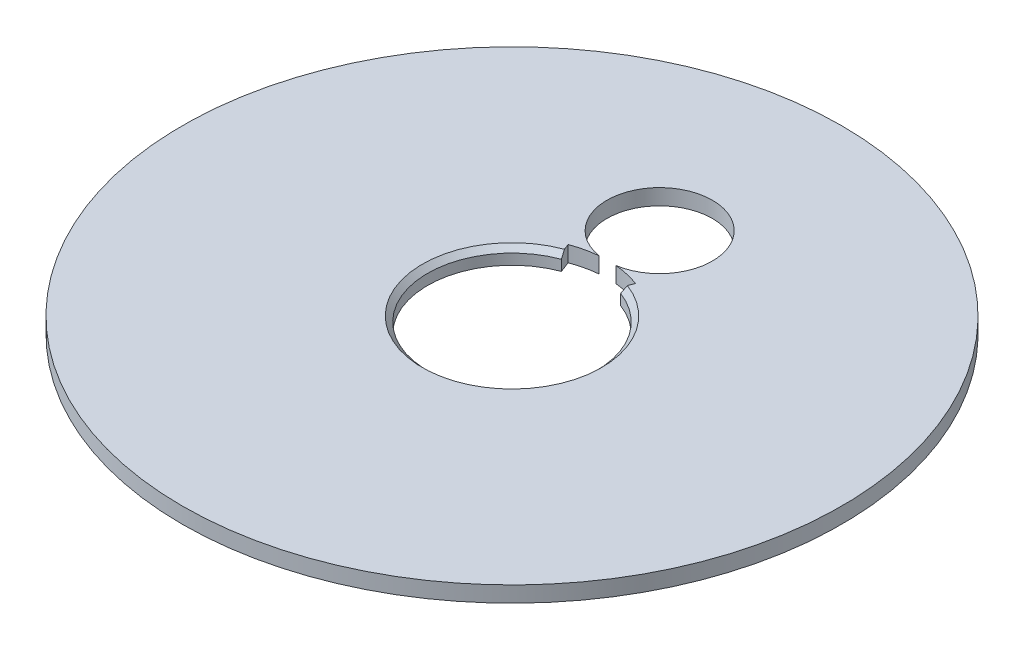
ISO-10303-21;
HEADER;
FILE_DESCRIPTION(('STEP AP214'),'2;1');
FILE_NAME('part.step','',(''),(''),'','','');
FILE_SCHEMA(('AUTOMOTIVE_DESIGN { 1 0 10303 214 1 1 1 1 }'));
ENDSEC;
DATA;
#1=APPLICATION_CONTEXT('core data for automotive mechanical design processes');
#2=APPLICATION_PROTOCOL_DEFINITION('international standard','automotive_design',2000,#1);
#3=PRODUCT_CONTEXT('',#1,'mechanical');
#4=PRODUCT('Part','Part','',(#3));
#5=PRODUCT_RELATED_PRODUCT_CATEGORY('part','',(#4));
#6=PRODUCT_DEFINITION_FORMATION('','',#4);
#7=PRODUCT_DEFINITION_CONTEXT('part definition',#1,'design');
#8=PRODUCT_DEFINITION('design','',#6,#7);
#9=PRODUCT_DEFINITION_SHAPE('','',#8);
#10=(LENGTH_UNIT() NAMED_UNIT(*) SI_UNIT(.MILLI.,.METRE.));
#11=(NAMED_UNIT(*) PLANE_ANGLE_UNIT() SI_UNIT($,.RADIAN.));
#12=(NAMED_UNIT(*) SI_UNIT($,.STERADIAN.) SOLID_ANGLE_UNIT());
#13=UNCERTAINTY_MEASURE_WITH_UNIT(LENGTH_MEASURE(1.E-05),#10,'distance_accuracy_value','');
#14=(GEOMETRIC_REPRESENTATION_CONTEXT(3) GLOBAL_UNCERTAINTY_ASSIGNED_CONTEXT((#13)) GLOBAL_UNIT_ASSIGNED_CONTEXT((#10,
#11,#12)) REPRESENTATION_CONTEXT('',''));
#15=CARTESIAN_POINT('',(0.,0.,0.));
#16=DIRECTION('',(0.,0.,1.));
#17=DIRECTION('',(1.,0.,0.));
#18=AXIS2_PLACEMENT_3D('',#15,#16,#17);
#19=CARTESIAN_POINT('',(0.,-1.5,0.));
#20=DIRECTION('',(0.,1.,0.));
#21=DIRECTION('',(0.,0.,1.));
#22=AXIS2_PLACEMENT_3D('',#19,#20,#21);
#23=CYLINDRICAL_SURFACE('',#22,9.1);
#24=CARTESIAN_POINT('',(0.,-1.5,0.));
#25=DIRECTION('',(0.,1.,0.));
#26=DIRECTION('',(0.,0.,1.));
#27=AXIS2_PLACEMENT_3D('',#24,#25,#26);
#28=CIRCLE('',#27,9.1);
#29=CARTESIAN_POINT('',(-0.801404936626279,-1.5,-9.06464285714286));
#30=VERTEX_POINT('',#29);
#31=CARTESIAN_POINT('',(-3.19522331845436,-1.5,-8.52059551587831));
#32=VERTEX_POINT('',#31);
#33=EDGE_CURVE('E160',#30,#32,#28,.T.);
#34=ORIENTED_EDGE('',*,*,#33,.F.);
#35=DIRECTION('',(0.,1.,0.));
#36=VECTOR('',#35,1.);
#37=CARTESIAN_POINT('',(-0.801404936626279,-5.,-9.06464285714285));
#38=LINE('',#37,#36);
#39=CARTESIAN_POINT('',(-0.801404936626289,0.,-9.06464285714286));
#40=VERTEX_POINT('',#39);
#41=EDGE_CURVE('E11',#30,#40,#38,.T.);
#42=ORIENTED_EDGE('',*,*,#41,.T.);
#43=CARTESIAN_POINT('',(0.,0.,0.));
#44=DIRECTION('',(0.,1.,0.));
#45=DIRECTION('',(0.,0.,1.));
#46=AXIS2_PLACEMENT_3D('',#43,#44,#45);
#47=CIRCLE('',#46,9.1);
#48=CARTESIAN_POINT('',(-3.19522331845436,0.,-8.52059551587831));
#49=VERTEX_POINT('',#48);
#50=EDGE_CURVE('E103',#40,#49,#47,.T.);
#51=ORIENTED_EDGE('',*,*,#50,.T.);
#52=DIRECTION('',(0.,1.,0.));
#53=VECTOR('',#52,1.);
#54=CARTESIAN_POINT('',(-3.19522331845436,-1.5,-8.52059551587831));
#55=LINE('',#54,#53);
#56=EDGE_CURVE('E125',#32,#49,#55,.T.);
#57=ORIENTED_EDGE('',*,*,#56,.F.);
#58=EDGE_LOOP('',(#34,#42,#51,#57));
#59=FACE_BOUND('',#58,.T.);
#60=ADVANCED_FACE('F32',(#59),#23,.F.);
#61=CARTESIAN_POINT('',(0.,-1.5,0.));
#62=DIRECTION('',(0.,1.,0.));
#63=DIRECTION('',(0.,0.,1.));
#64=AXIS2_PLACEMENT_3D('',#61,#62,#63);
#65=CYLINDRICAL_SURFACE('',#64,31.25);
#66=CARTESIAN_POINT('',(0.,-1.5,0.));
#67=DIRECTION('',(0.,1.,0.));
#68=DIRECTION('',(0.,0.,1.));
#69=AXIS2_PLACEMENT_3D('',#66,#67,#68);
#70=CIRCLE('',#69,31.25);
#71=CARTESIAN_POINT('',(0.,-1.5,31.25));
#72=VERTEX_POINT('',#71);
#73=EDGE_CURVE('E129',#72,#72,#70,.T.);
#74=ORIENTED_EDGE('',*,*,#73,.T.);
#75=EDGE_LOOP('',(#74));
#76=FACE_BOUND('',#75,.T.);
#77=CARTESIAN_POINT('',(0.,0.,0.));
#78=DIRECTION('',(0.,1.,0.));
#79=DIRECTION('',(0.,0.,1.));
#80=AXIS2_PLACEMENT_3D('',#77,#78,#79);
#81=CIRCLE('',#80,31.25);
#82=CARTESIAN_POINT('',(0.,0.,31.25));
#83=VERTEX_POINT('',#82);
#84=EDGE_CURVE('E121',#83,#83,#81,.T.);
#85=ORIENTED_EDGE('',*,*,#84,.F.);
#86=EDGE_LOOP('',(#85));
#87=FACE_BOUND('',#86,.T.);
#88=ADVANCED_FACE('F168',(#76,#87),#65,.T.);
#89=CARTESIAN_POINT('',(0.,-1.5,0.));
#90=DIRECTION('',(0.,1.,0.));
#91=DIRECTION('',(0.,0.,1.));
#92=AXIS2_PLACEMENT_3D('',#89,#90,#91);
#93=PLANE('',#92);
#94=CARTESIAN_POINT('',(3.19522331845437,-1.5,-8.5205955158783));
#95=VERTEX_POINT('',#94);
#96=CARTESIAN_POINT('',(0.80140493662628,-1.5,-9.06464285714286));
#97=VERTEX_POINT('',#96);
#98=EDGE_CURVE('E159',#95,#97,#28,.T.);
#99=ORIENTED_EDGE('',*,*,#98,.T.);
#100=CARTESIAN_POINT('',(0.,-1.5,-14.));
#101=DIRECTION('',(0.,1.,0.));
#102=DIRECTION('',(0.,0.,1.));
#103=AXIS2_PLACEMENT_3D('',#100,#101,#102);
#104=CIRCLE('',#103,5.);
#105=EDGE_CURVE('E47',#97,#30,#104,.T.);
#106=ORIENTED_EDGE('',*,*,#105,.T.);
#107=ORIENTED_EDGE('',*,*,#33,.T.);
#108=DIRECTION('',(0.351123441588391,0.,0.936329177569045));
#109=VECTOR('',#108,1.);
#110=CARTESIAN_POINT('',(-3.,-1.5,-8.));
#111=LINE('',#110,#109);
#112=CARTESIAN_POINT('',(-2.80898753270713,-1.5,-7.49063342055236));
#113=VERTEX_POINT('',#112);
#114=EDGE_CURVE('E158',#32,#113,#111,.T.);
#115=ORIENTED_EDGE('',*,*,#114,.T.);
#116=CARTESIAN_POINT('',(0.,-1.5,0.));
#117=DIRECTION('',(0.,1.,0.));
#118=DIRECTION('',(0.,0.,1.));
#119=AXIS2_PLACEMENT_3D('',#116,#117,#118);
#120=CIRCLE('',#119,8.);
#121=CARTESIAN_POINT('',(2.80898753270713,-1.5,-7.49063342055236));
#122=VERTEX_POINT('',#121);
#123=EDGE_CURVE('E113',#113,#122,#120,.T.);
#124=ORIENTED_EDGE('',*,*,#123,.T.);
#125=DIRECTION('',(0.351123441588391,0.,-0.936329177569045));
#126=VECTOR('',#125,1.);
#127=CARTESIAN_POINT('',(3.,-1.5,-8.));
#128=LINE('',#127,#126);
#129=EDGE_CURVE('E117',#122,#95,#128,.T.);
#130=ORIENTED_EDGE('',*,*,#129,.T.);
#131=EDGE_LOOP('',(#99,#106,#107,#115,#124,#130));
#132=FACE_BOUND('',#131,.T.);
#133=ORIENTED_EDGE('',*,*,#73,.F.);
#134=EDGE_LOOP('',(#133));
#135=FACE_BOUND('',#134,.T.);
#136=ADVANCED_FACE('F156',(#132,#135),#93,.F.);
#137=CARTESIAN_POINT('',(0.,0.,0.));
#138=DIRECTION('',(0.,1.,0.));
#139=DIRECTION('',(0.,0.,1.));
#140=AXIS2_PLACEMENT_3D('',#137,#138,#139);
#141=PLANE('',#140);
#142=CARTESIAN_POINT('',(0.,0.,-14.));
#143=DIRECTION('',(0.,1.,0.));
#144=DIRECTION('',(0.,0.,1.));
#145=AXIS2_PLACEMENT_3D('',#142,#143,#144);
#146=CIRCLE('',#145,5.);
#147=CARTESIAN_POINT('',(0.801404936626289,0.,-9.06464285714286));
#148=VERTEX_POINT('',#147);
#149=EDGE_CURVE('E92',#148,#40,#146,.T.);
#150=ORIENTED_EDGE('',*,*,#149,.F.);
#151=CARTESIAN_POINT('',(3.19522331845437,0.,-8.52059551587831));
#152=VERTEX_POINT('',#151);
#153=EDGE_CURVE('E102',#152,#148,#47,.T.);
#154=ORIENTED_EDGE('',*,*,#153,.F.);
#155=DIRECTION('',(0.351123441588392,0.,-0.936329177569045));
#156=VECTOR('',#155,1.);
#157=CARTESIAN_POINT('',(2.80898753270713,0.,-7.49063342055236));
#158=LINE('',#157,#156);
#159=CARTESIAN_POINT('',(2.98454925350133,0.,-7.95879800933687));
#160=VERTEX_POINT('',#159);
#161=EDGE_CURVE('E110',#160,#152,#158,.T.);
#162=ORIENTED_EDGE('',*,*,#161,.F.);
#163=CARTESIAN_POINT('',(0.,0.,0.));
#164=DIRECTION('',(0.,1.,0.));
#165=DIRECTION('',(0.,0.,1.));
#166=AXIS2_PLACEMENT_3D('',#163,#164,#165);
#167=CIRCLE('',#166,8.49999999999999);
#168=CARTESIAN_POINT('',(-2.98454925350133,0.,-7.95879800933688));
#169=VERTEX_POINT('',#168);
#170=EDGE_CURVE('E55',#160,#169,#167,.F.);
#171=ORIENTED_EDGE('',*,*,#170,.T.);
#172=DIRECTION('',(0.351123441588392,0.,0.936329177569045));
#173=VECTOR('',#172,1.);
#174=CARTESIAN_POINT('',(-2.80898753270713,0.,-7.49063342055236));
#175=LINE('',#174,#173);
#176=EDGE_CURVE('E108',#49,#169,#175,.T.);
#177=ORIENTED_EDGE('',*,*,#176,.F.);
#178=ORIENTED_EDGE('',*,*,#50,.F.);
#179=EDGE_LOOP('',(#150,#154,#162,#171,#177,#178));
#180=FACE_BOUND('',#179,.T.);
#181=ORIENTED_EDGE('',*,*,#84,.T.);
#182=EDGE_LOOP('',(#181));
#183=FACE_BOUND('',#182,.T.);
#184=ADVANCED_FACE('F100',(#180,#183),#141,.T.);
#185=CARTESIAN_POINT('',(2.80898753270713,-1.5,-7.49063342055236));
#186=DIRECTION('',(0.936329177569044,0.,0.351123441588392));
#187=DIRECTION('',(0.351123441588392,0.,-0.936329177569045));
#188=AXIS2_PLACEMENT_3D('',#185,#186,#187);
#189=PLANE('',#188);
#190=DIRECTION('',(0.,1.,0.));
#191=VECTOR('',#190,1.);
#192=CARTESIAN_POINT('',(2.80898753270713,-1.5,-7.49063342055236));
#193=LINE('',#192,#191);
#194=CARTESIAN_POINT('',(2.80898753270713,-0.49999999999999,-7.49063342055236));
#195=VERTEX_POINT('',#194);
#196=EDGE_CURVE('E118',#122,#195,#193,.T.);
#197=ORIENTED_EDGE('',*,*,#196,.T.);
#198=DIRECTION('',(0.24828176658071,0.707106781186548,-0.662084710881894));
#199=VECTOR('',#198,1.);
#200=CARTESIAN_POINT('',(0.,-8.49999999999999,0.));
#201=LINE('',#200,#199);
#202=EDGE_CURVE('E137',#195,#160,#201,.T.);
#203=ORIENTED_EDGE('',*,*,#202,.T.);
#204=ORIENTED_EDGE('',*,*,#161,.T.);
#205=DIRECTION('',(0.,1.,0.));
#206=VECTOR('',#205,1.);
#207=CARTESIAN_POINT('',(3.19522331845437,-1.5,-8.5205955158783));
#208=LINE('',#207,#206);
#209=EDGE_CURVE('E107',#95,#152,#208,.T.);
#210=ORIENTED_EDGE('',*,*,#209,.F.);
#211=ORIENTED_EDGE('',*,*,#129,.F.);
#212=EDGE_LOOP('',(#197,#203,#204,#210,#211));
#213=FACE_BOUND('',#212,.T.);
#214=ADVANCED_FACE('F153',(#213),#189,.F.);
#215=CARTESIAN_POINT('',(0.,-1.5,0.));
#216=DIRECTION('',(0.,1.,0.));
#217=DIRECTION('',(0.,0.,1.));
#218=AXIS2_PLACEMENT_3D('',#215,#216,#217);
#219=CYLINDRICAL_SURFACE('',#218,8.);
#220=DIRECTION('',(0.,1.,0.));
#221=VECTOR('',#220,1.);
#222=CARTESIAN_POINT('',(-2.80898753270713,-1.5,-7.49063342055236));
#223=LINE('',#222,#221);
#224=CARTESIAN_POINT('',(-2.80898753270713,-0.49999999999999,-7.49063342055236));
#225=VERTEX_POINT('',#224);
#226=EDGE_CURVE('E122',#113,#225,#223,.T.);
#227=ORIENTED_EDGE('',*,*,#226,.T.);
#228=CARTESIAN_POINT('',(0.,-0.499999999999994,0.));
#229=DIRECTION('',(0.,1.,0.));
#230=DIRECTION('',(0.,0.,1.));
#231=AXIS2_PLACEMENT_3D('',#228,#229,#230);
#232=CIRCLE('',#231,8.);
#233=EDGE_CURVE('E132',#225,#195,#232,.T.);
#234=ORIENTED_EDGE('',*,*,#233,.T.);
#235=ORIENTED_EDGE('',*,*,#196,.F.);
#236=ORIENTED_EDGE('',*,*,#123,.F.);
#237=EDGE_LOOP('',(#227,#234,#235,#236));
#238=FACE_BOUND('',#237,.T.);
#239=ADVANCED_FACE('F148',(#238),#219,.F.);
#240=CARTESIAN_POINT('',(-2.80898753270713,-1.5,-7.49063342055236));
#241=DIRECTION('',(-0.936329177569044,0.,0.351123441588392));
#242=DIRECTION('',(0.351123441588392,0.,0.936329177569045));
#243=AXIS2_PLACEMENT_3D('',#240,#241,#242);
#244=PLANE('',#243);
#245=ORIENTED_EDGE('',*,*,#176,.T.);
#246=DIRECTION('',(0.24828176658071,-0.707106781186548,0.662084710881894));
#247=VECTOR('',#246,1.);
#248=CARTESIAN_POINT('',(0.,-8.49999999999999,0.));
#249=LINE('',#248,#247);
#250=EDGE_CURVE('E97',#169,#225,#249,.T.);
#251=ORIENTED_EDGE('',*,*,#250,.T.);
#252=ORIENTED_EDGE('',*,*,#226,.F.);
#253=ORIENTED_EDGE('',*,*,#114,.F.);
#254=ORIENTED_EDGE('',*,*,#56,.T.);
#255=EDGE_LOOP('',(#245,#251,#252,#253,#254));
#256=FACE_BOUND('',#255,.T.);
#257=ADVANCED_FACE('F142',(#256),#244,.F.);
#258=ORIENTED_EDGE('',*,*,#153,.T.);
#259=DIRECTION('',(0.,1.,0.));
#260=VECTOR('',#259,1.);
#261=CARTESIAN_POINT('',(0.801404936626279,-5.,-9.06464285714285));
#262=LINE('',#261,#260);
#263=EDGE_CURVE('E40',#148,#97,#262,.F.);
#264=ORIENTED_EDGE('',*,*,#263,.T.);
#265=ORIENTED_EDGE('',*,*,#98,.F.);
#266=ORIENTED_EDGE('',*,*,#209,.T.);
#267=EDGE_LOOP('',(#258,#264,#265,#266));
#268=FACE_BOUND('',#267,.T.);
#269=ADVANCED_FACE('F106',(#268),#23,.F.);
#270=CARTESIAN_POINT('',(0.,-0.499999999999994,0.));
#271=DIRECTION('',(0.,1.,0.));
#272=DIRECTION('',(0.,0.,1.));
#273=AXIS2_PLACEMENT_3D('',#270,#271,#272);
#274=CONICAL_SURFACE('',#273,8.,0.785398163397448);
#275=ORIENTED_EDGE('',*,*,#250,.F.);
#276=ORIENTED_EDGE('',*,*,#170,.F.);
#277=ORIENTED_EDGE('',*,*,#202,.F.);
#278=ORIENTED_EDGE('',*,*,#233,.F.);
#279=EDGE_LOOP('',(#275,#276,#277,#278));
#280=FACE_BOUND('',#279,.T.);
#281=ADVANCED_FACE('F34',(#280),#274,.F.);
#282=CARTESIAN_POINT('',(0.,-10.,-14.));
#283=DIRECTION('',(0.,1.,0.));
#284=DIRECTION('',(0.,0.,1.));
#285=AXIS2_PLACEMENT_3D('',#282,#283,#284);
#286=CYLINDRICAL_SURFACE('',#285,5.);
#287=ORIENTED_EDGE('',*,*,#105,.F.);
#288=ORIENTED_EDGE('',*,*,#263,.F.);
#289=ORIENTED_EDGE('',*,*,#149,.T.);
#290=ORIENTED_EDGE('',*,*,#41,.F.);
#291=EDGE_LOOP('',(#287,#288,#289,#290));
#292=FACE_BOUND('',#291,.T.);
#293=ADVANCED_FACE('F91',(#292),#286,.F.);
#294=CLOSED_SHELL('',(#60,#88,#136,#184,#214,#239,#257,#269,#281,#293));
#295=MANIFOLD_SOLID_BREP('B2',#294);
#296=ADVANCED_BREP_SHAPE_REPRESENTATION('',(#18,#295),#14);
#297=SHAPE_DEFINITION_REPRESENTATION(#9,#296);
ENDSEC;
END-ISO-10303-21;
